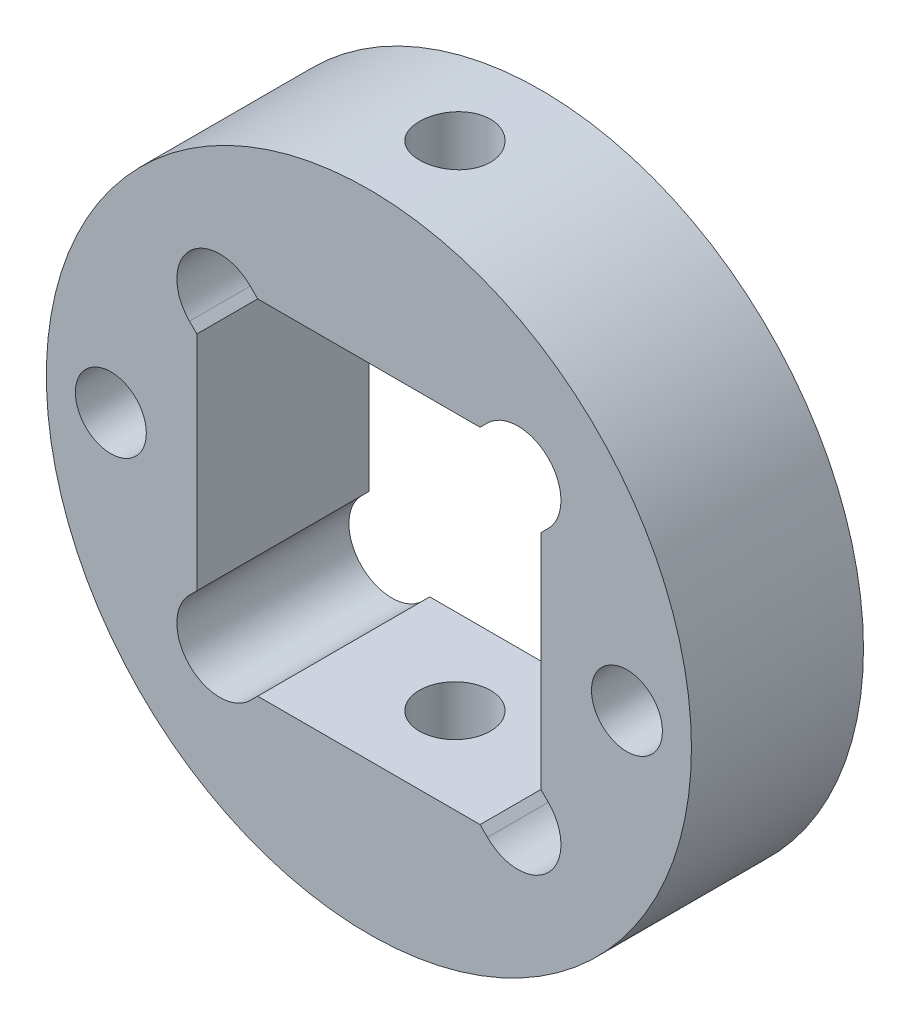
ISO-10303-21;
HEADER;
FILE_DESCRIPTION(('STEP AP214'),'2;1');
FILE_NAME('part.step','',(''),(''),'','','');
FILE_SCHEMA(('AUTOMOTIVE_DESIGN { 1 0 10303 214 1 1 1 1 }'));
ENDSEC;
DATA;
#1=APPLICATION_CONTEXT('core data for automotive mechanical design processes');
#2=APPLICATION_PROTOCOL_DEFINITION('international standard','automotive_design',2000,#1);
#3=PRODUCT_CONTEXT('',#1,'mechanical');
#4=PRODUCT('Part','Part','',(#3));
#5=PRODUCT_RELATED_PRODUCT_CATEGORY('part','',(#4));
#6=PRODUCT_DEFINITION_FORMATION('','',#4);
#7=PRODUCT_DEFINITION_CONTEXT('part definition',#1,'design');
#8=PRODUCT_DEFINITION('design','',#6,#7);
#9=PRODUCT_DEFINITION_SHAPE('','',#8);
#10=(LENGTH_UNIT() NAMED_UNIT(*) SI_UNIT(.MILLI.,.METRE.));
#11=(NAMED_UNIT(*) PLANE_ANGLE_UNIT() SI_UNIT($,.RADIAN.));
#12=(NAMED_UNIT(*) SI_UNIT($,.STERADIAN.) SOLID_ANGLE_UNIT());
#13=UNCERTAINTY_MEASURE_WITH_UNIT(LENGTH_MEASURE(1.E-05),#10,'distance_accuracy_value','');
#14=(GEOMETRIC_REPRESENTATION_CONTEXT(3) GLOBAL_UNCERTAINTY_ASSIGNED_CONTEXT((#13)) GLOBAL_UNIT_ASSIGNED_CONTEXT((#10,
#11,#12)) REPRESENTATION_CONTEXT('',''));
#15=CARTESIAN_POINT('',(0.,0.,0.));
#16=DIRECTION('',(0.,0.,1.));
#17=DIRECTION('',(1.,0.,0.));
#18=AXIS2_PLACEMENT_3D('',#15,#16,#17);
#19=CARTESIAN_POINT('',(0.,0.,4.));
#20=DIRECTION('',(0.,0.,1.));
#21=DIRECTION('',(1.,0.,0.));
#22=AXIS2_PLACEMENT_3D('',#19,#20,#21);
#23=PLANE('',#22);
#24=CARTESIAN_POINT('',(-12.,0.,4.));
#25=DIRECTION('',(0.,0.,1.));
#26=DIRECTION('',(1.,0.,0.));
#27=AXIS2_PLACEMENT_3D('',#24,#25,#26);
#28=CIRCLE('',#27,1.64999999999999);
#29=CARTESIAN_POINT('',(-10.35,0.,4.));
#30=VERTEX_POINT('',#29);
#31=EDGE_CURVE('E418',#30,#30,#28,.T.);
#32=ORIENTED_EDGE('',*,*,#31,.F.);
#33=EDGE_LOOP('',(#32));
#34=FACE_BOUND('',#33,.T.);
#35=CARTESIAN_POINT('',(12.,0.,4.));
#36=DIRECTION('',(0.,0.,1.));
#37=DIRECTION('',(1.,0.,0.));
#38=AXIS2_PLACEMENT_3D('',#35,#36,#37);
#39=CIRCLE('',#38,1.64999999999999);
#40=CARTESIAN_POINT('',(13.65,0.,4.));
#41=VERTEX_POINT('',#40);
#42=EDGE_CURVE('E413',#41,#41,#39,.T.);
#43=ORIENTED_EDGE('',*,*,#42,.F.);
#44=EDGE_LOOP('',(#43));
#45=FACE_BOUND('',#44,.T.);
#46=CARTESIAN_POINT('',(0.,0.,4.));
#47=DIRECTION('',(0.,0.,1.));
#48=DIRECTION('',(1.,0.,0.));
#49=AXIS2_PLACEMENT_3D('',#46,#47,#48);
#50=CIRCLE('',#49,15.);
#51=CARTESIAN_POINT('',(15.,0.,4.));
#52=VERTEX_POINT('',#51);
#53=EDGE_CURVE('E274',#52,#52,#50,.T.);
#54=ORIENTED_EDGE('',*,*,#53,.T.);
#55=EDGE_LOOP('',(#54));
#56=FACE_BOUND('',#55,.T.);
#57=CARTESIAN_POINT('',(6.92964645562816,6.92964645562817,4.));
#58=DIRECTION('',(0.,0.,1.));
#59=DIRECTION('',(1.,0.,0.));
#60=AXIS2_PLACEMENT_3D('',#57,#58,#59);
#61=CIRCLE('',#60,1.99999999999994);
#62=CARTESIAN_POINT('',(8.34386001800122,5.51543289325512,4.));
#63=VERTEX_POINT('',#62);
#64=CARTESIAN_POINT('',(5.51543289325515,8.34386001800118,4.));
#65=VERTEX_POINT('',#64);
#66=EDGE_CURVE('E159',#63,#65,#61,.T.);
#67=ORIENTED_EDGE('',*,*,#66,.F.);
#68=DIRECTION('',(0.707106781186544,0.707106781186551,0.));
#69=VECTOR('',#68,1.);
#70=CARTESIAN_POINT('',(8.34386001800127,5.51543289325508,4.));
#71=LINE('',#70,#69);
#72=CARTESIAN_POINT('',(8.,5.17157287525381,4.));
#73=VERTEX_POINT('',#72);
#74=EDGE_CURVE('E151',#73,#63,#71,.T.);
#75=ORIENTED_EDGE('',*,*,#74,.F.);
#76=DIRECTION('',(0.,1.,0.));
#77=VECTOR('',#76,1.);
#78=CARTESIAN_POINT('',(8.,5.17157287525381,4.));
#79=LINE('',#78,#77);
#80=CARTESIAN_POINT('',(8.00000000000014,-5.17157287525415,4.));
#81=VERTEX_POINT('',#80);
#82=EDGE_CURVE('E201',#81,#73,#79,.T.);
#83=ORIENTED_EDGE('',*,*,#82,.F.);
#84=DIRECTION('',(-0.707106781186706,0.707106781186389,0.));
#85=VECTOR('',#84,1.);
#86=CARTESIAN_POINT('',(8.34386001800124,-5.51543289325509,4.));
#87=LINE('',#86,#85);
#88=CARTESIAN_POINT('',(8.34386001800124,-5.51543289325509,4.));
#89=VERTEX_POINT('',#88);
#90=EDGE_CURVE('E199',#89,#81,#87,.T.);
#91=ORIENTED_EDGE('',*,*,#90,.F.);
#92=CARTESIAN_POINT('',(6.92964645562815,-6.92964645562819,4.));
#93=DIRECTION('',(0.,0.,1.));
#94=DIRECTION('',(1.,0.,0.));
#95=AXIS2_PLACEMENT_3D('',#92,#93,#94);
#96=CIRCLE('',#95,2.);
#97=CARTESIAN_POINT('',(5.51543289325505,-8.34386001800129,4.));
#98=VERTEX_POINT('',#97);
#99=EDGE_CURVE('E197',#98,#89,#96,.T.);
#100=ORIENTED_EDGE('',*,*,#99,.F.);
#101=DIRECTION('',(0.707106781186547,-0.707106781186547,0.));
#102=VECTOR('',#101,1.);
#103=CARTESIAN_POINT('',(5.51543289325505,-8.34386001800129,4.));
#104=LINE('',#103,#102);
#105=CARTESIAN_POINT('',(5.17157287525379,-8.00000000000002,4.));
#106=VERTEX_POINT('',#105);
#107=EDGE_CURVE('E195',#106,#98,#104,.T.);
#108=ORIENTED_EDGE('',*,*,#107,.F.);
#109=DIRECTION('',(1.,0.,0.));
#110=VECTOR('',#109,1.);
#111=CARTESIAN_POINT('',(-5.17157287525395,-8.00000000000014,4.));
#112=LINE('',#111,#110);
#113=CARTESIAN_POINT('',(-5.17157287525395,-8.00000000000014,4.));
#114=VERTEX_POINT('',#113);
#115=EDGE_CURVE('E193',#114,#106,#112,.T.);
#116=ORIENTED_EDGE('',*,*,#115,.F.);
#117=DIRECTION('',(0.707106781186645,0.70710678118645,0.));
#118=VECTOR('',#117,1.);
#119=CARTESIAN_POINT('',(-5.51543289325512,-8.34386001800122,4.));
#120=LINE('',#119,#118);
#121=CARTESIAN_POINT('',(-5.51543289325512,-8.34386001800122,4.));
#122=VERTEX_POINT('',#121);
#123=EDGE_CURVE('E191',#122,#114,#120,.T.);
#124=ORIENTED_EDGE('',*,*,#123,.F.);
#125=CARTESIAN_POINT('',(-6.92964645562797,-6.92964645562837,4.));
#126=DIRECTION('',(0.,0.,1.));
#127=DIRECTION('',(1.,0.,0.));
#128=AXIS2_PLACEMENT_3D('',#125,#126,#127);
#129=CIRCLE('',#128,1.99999999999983);
#130=CARTESIAN_POINT('',(-8.34386001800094,-5.5154328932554,4.));
#131=VERTEX_POINT('',#130);
#132=EDGE_CURVE('E189',#131,#122,#129,.T.);
#133=ORIENTED_EDGE('',*,*,#132,.F.);
#134=DIRECTION('',(-0.707106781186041,-0.707106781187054,0.));
#135=VECTOR('',#134,1.);
#136=CARTESIAN_POINT('',(-8.34386001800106,-5.51543289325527,4.));
#137=LINE('',#136,#135);
#138=CARTESIAN_POINT('',(-8.00000000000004,-5.17157287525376,4.));
#139=VERTEX_POINT('',#138);
#140=EDGE_CURVE('E187',#139,#131,#137,.T.);
#141=ORIENTED_EDGE('',*,*,#140,.F.);
#142=DIRECTION('',(0.,-1.,0.));
#143=VECTOR('',#142,1.);
#144=CARTESIAN_POINT('',(-7.99999999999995,5.17157287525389,4.));
#145=LINE('',#144,#143);
#146=CARTESIAN_POINT('',(-7.99999999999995,5.17157287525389,4.));
#147=VERTEX_POINT('',#146);
#148=EDGE_CURVE('E185',#147,#139,#145,.T.);
#149=ORIENTED_EDGE('',*,*,#148,.F.);
#150=DIRECTION('',(0.70710678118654,-0.707106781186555,0.));
#151=VECTOR('',#150,1.);
#152=CARTESIAN_POINT('',(-8.3438600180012,5.51543289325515,4.));
#153=LINE('',#152,#151);
#154=CARTESIAN_POINT('',(-8.3438600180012,5.51543289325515,4.));
#155=VERTEX_POINT('',#154);
#156=EDGE_CURVE('E183',#155,#147,#153,.T.);
#157=ORIENTED_EDGE('',*,*,#156,.F.);
#158=CARTESIAN_POINT('',(-6.9296464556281,6.92964645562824,4.));
#159=DIRECTION('',(0.,0.,1.));
#160=DIRECTION('',(1.,0.,0.));
#161=AXIS2_PLACEMENT_3D('',#158,#159,#160);
#162=CIRCLE('',#161,2.);
#163=CARTESIAN_POINT('',(-5.515432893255,8.34386001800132,4.));
#164=VERTEX_POINT('',#163);
#165=EDGE_CURVE('E181',#164,#155,#162,.T.);
#166=ORIENTED_EDGE('',*,*,#165,.F.);
#167=DIRECTION('',(-0.707106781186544,0.707106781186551,0.));
#168=VECTOR('',#167,1.);
#169=CARTESIAN_POINT('',(-5.515432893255,8.34386001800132,4.));
#170=LINE('',#169,#168);
#171=CARTESIAN_POINT('',(-5.17157287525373,8.00000000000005,4.));
#172=VERTEX_POINT('',#171);
#173=EDGE_CURVE('E179',#172,#164,#170,.T.);
#174=ORIENTED_EDGE('',*,*,#173,.F.);
#175=DIRECTION('',(-1.,0.,0.));
#176=VECTOR('',#175,1.);
#177=CARTESIAN_POINT('',(-5.17157287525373,8.00000000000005,4.));
#178=LINE('',#177,#176);
#179=CARTESIAN_POINT('',(5.17157287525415,7.99999999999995,4.));
#180=VERTEX_POINT('',#179);
#181=EDGE_CURVE('E174',#180,#172,#178,.T.);
#182=ORIENTED_EDGE('',*,*,#181,.F.);
#183=DIRECTION('',(-0.707106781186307,-0.707106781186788,0.));
#184=VECTOR('',#183,1.);
#185=CARTESIAN_POINT('',(5.51543289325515,8.34386001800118,4.));
#186=LINE('',#185,#184);
#187=EDGE_CURVE('E172',#65,#180,#186,.T.);
#188=ORIENTED_EDGE('',*,*,#187,.F.);
#189=EDGE_LOOP('',(#67,#75,#83,#91,#100,#108,#116,#124,#133,#141,#149,#157,#166,#174,#182,#188));
#190=FACE_BOUND('',#189,.T.);
#191=ADVANCED_FACE('F34',(#34,#45,#56,#190),#23,.T.);
#192=CARTESIAN_POINT('',(0.,0.,-4.));
#193=DIRECTION('',(0.,0.,1.));
#194=DIRECTION('',(1.,0.,0.));
#195=AXIS2_PLACEMENT_3D('',#192,#193,#194);
#196=PLANE('',#195);
#197=CARTESIAN_POINT('',(-12.,0.,-4.));
#198=DIRECTION('',(0.,0.,1.));
#199=DIRECTION('',(1.,0.,0.));
#200=AXIS2_PLACEMENT_3D('',#197,#198,#199);
#201=CIRCLE('',#200,1.65);
#202=CARTESIAN_POINT('',(-10.35,0.,-4.));
#203=VERTEX_POINT('',#202);
#204=EDGE_CURVE('E368',#203,#203,#201,.T.);
#205=ORIENTED_EDGE('',*,*,#204,.T.);
#206=EDGE_LOOP('',(#205));
#207=FACE_BOUND('',#206,.T.);
#208=CARTESIAN_POINT('',(12.,0.,-4.));
#209=DIRECTION('',(0.,0.,1.));
#210=DIRECTION('',(1.,0.,0.));
#211=AXIS2_PLACEMENT_3D('',#208,#209,#210);
#212=CIRCLE('',#211,1.65);
#213=CARTESIAN_POINT('',(13.65,0.,-4.));
#214=VERTEX_POINT('',#213);
#215=EDGE_CURVE('E204',#214,#214,#212,.T.);
#216=ORIENTED_EDGE('',*,*,#215,.T.);
#217=EDGE_LOOP('',(#216));
#218=FACE_BOUND('',#217,.T.);
#219=CARTESIAN_POINT('',(0.,0.,-4.));
#220=DIRECTION('',(0.,0.,1.));
#221=DIRECTION('',(1.,0.,0.));
#222=AXIS2_PLACEMENT_3D('',#219,#220,#221);
#223=CIRCLE('',#222,15.);
#224=CARTESIAN_POINT('',(15.,0.,-4.));
#225=VERTEX_POINT('',#224);
#226=EDGE_CURVE('E167',#225,#225,#223,.T.);
#227=ORIENTED_EDGE('',*,*,#226,.F.);
#228=EDGE_LOOP('',(#227));
#229=FACE_BOUND('',#228,.T.);
#230=DIRECTION('',(0.707106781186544,0.707106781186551,0.));
#231=VECTOR('',#230,1.);
#232=CARTESIAN_POINT('',(8.34386001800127,5.51543289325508,-4.));
#233=LINE('',#232,#231);
#234=CARTESIAN_POINT('',(8.,5.17157287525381,-4.));
#235=VERTEX_POINT('',#234);
#236=CARTESIAN_POINT('',(8.34386001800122,5.51543289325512,-4.));
#237=VERTEX_POINT('',#236);
#238=EDGE_CURVE('E61',#235,#237,#233,.T.);
#239=ORIENTED_EDGE('',*,*,#238,.T.);
#240=CARTESIAN_POINT('',(6.92964645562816,6.92964645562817,-4.));
#241=DIRECTION('',(0.,0.,1.));
#242=DIRECTION('',(1.,0.,0.));
#243=AXIS2_PLACEMENT_3D('',#240,#241,#242);
#244=CIRCLE('',#243,1.99999999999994);
#245=CARTESIAN_POINT('',(5.51543289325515,8.34386001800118,-4.));
#246=VERTEX_POINT('',#245);
#247=EDGE_CURVE('E166',#237,#246,#244,.T.);
#248=ORIENTED_EDGE('',*,*,#247,.T.);
#249=DIRECTION('',(-0.707106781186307,-0.707106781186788,0.));
#250=VECTOR('',#249,1.);
#251=CARTESIAN_POINT('',(5.51543289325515,8.34386001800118,-4.));
#252=LINE('',#251,#250);
#253=CARTESIAN_POINT('',(5.17157287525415,7.99999999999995,-4.));
#254=VERTEX_POINT('',#253);
#255=EDGE_CURVE('E206',#246,#254,#252,.T.);
#256=ORIENTED_EDGE('',*,*,#255,.T.);
#257=DIRECTION('',(-1.,0.,0.));
#258=VECTOR('',#257,1.);
#259=CARTESIAN_POINT('',(-5.17157287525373,8.00000000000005,-4.));
#260=LINE('',#259,#258);
#261=CARTESIAN_POINT('',(-5.17157287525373,8.00000000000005,-4.));
#262=VERTEX_POINT('',#261);
#263=EDGE_CURVE('E209',#254,#262,#260,.T.);
#264=ORIENTED_EDGE('',*,*,#263,.T.);
#265=DIRECTION('',(-0.707106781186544,0.707106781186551,0.));
#266=VECTOR('',#265,1.);
#267=CARTESIAN_POINT('',(-5.515432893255,8.34386001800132,-4.));
#268=LINE('',#267,#266);
#269=CARTESIAN_POINT('',(-5.515432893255,8.34386001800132,-4.));
#270=VERTEX_POINT('',#269);
#271=EDGE_CURVE('E212',#262,#270,#268,.T.);
#272=ORIENTED_EDGE('',*,*,#271,.T.);
#273=CARTESIAN_POINT('',(-6.9296464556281,6.92964645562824,-4.));
#274=DIRECTION('',(0.,0.,1.));
#275=DIRECTION('',(1.,0.,0.));
#276=AXIS2_PLACEMENT_3D('',#273,#274,#275);
#277=CIRCLE('',#276,2.);
#278=CARTESIAN_POINT('',(-8.3438600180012,5.51543289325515,-4.));
#279=VERTEX_POINT('',#278);
#280=EDGE_CURVE('E215',#270,#279,#277,.T.);
#281=ORIENTED_EDGE('',*,*,#280,.T.);
#282=DIRECTION('',(0.70710678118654,-0.707106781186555,0.));
#283=VECTOR('',#282,1.);
#284=CARTESIAN_POINT('',(-8.3438600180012,5.51543289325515,-4.));
#285=LINE('',#284,#283);
#286=CARTESIAN_POINT('',(-7.99999999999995,5.17157287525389,-4.));
#287=VERTEX_POINT('',#286);
#288=EDGE_CURVE('E218',#279,#287,#285,.T.);
#289=ORIENTED_EDGE('',*,*,#288,.T.);
#290=DIRECTION('',(0.,-1.,0.));
#291=VECTOR('',#290,1.);
#292=CARTESIAN_POINT('',(-7.99999999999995,5.17157287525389,-4.));
#293=LINE('',#292,#291);
#294=CARTESIAN_POINT('',(-8.00000000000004,-5.17157287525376,-4.));
#295=VERTEX_POINT('',#294);
#296=EDGE_CURVE('E221',#287,#295,#293,.T.);
#297=ORIENTED_EDGE('',*,*,#296,.T.);
#298=DIRECTION('',(-0.707106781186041,-0.707106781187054,0.));
#299=VECTOR('',#298,1.);
#300=CARTESIAN_POINT('',(-8.34386001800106,-5.51543289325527,-4.));
#301=LINE('',#300,#299);
#302=CARTESIAN_POINT('',(-8.34386001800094,-5.5154328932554,-4.));
#303=VERTEX_POINT('',#302);
#304=EDGE_CURVE('E224',#295,#303,#301,.T.);
#305=ORIENTED_EDGE('',*,*,#304,.T.);
#306=CARTESIAN_POINT('',(-6.92964645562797,-6.92964645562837,-4.));
#307=DIRECTION('',(0.,0.,1.));
#308=DIRECTION('',(1.,0.,0.));
#309=AXIS2_PLACEMENT_3D('',#306,#307,#308);
#310=CIRCLE('',#309,1.99999999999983);
#311=CARTESIAN_POINT('',(-5.51543289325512,-8.34386001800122,-4.));
#312=VERTEX_POINT('',#311);
#313=EDGE_CURVE('E227',#303,#312,#310,.T.);
#314=ORIENTED_EDGE('',*,*,#313,.T.);
#315=DIRECTION('',(0.707106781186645,0.70710678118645,0.));
#316=VECTOR('',#315,1.);
#317=CARTESIAN_POINT('',(-5.51543289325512,-8.34386001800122,-4.));
#318=LINE('',#317,#316);
#319=CARTESIAN_POINT('',(-5.17157287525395,-8.00000000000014,-4.));
#320=VERTEX_POINT('',#319);
#321=EDGE_CURVE('E230',#312,#320,#318,.T.);
#322=ORIENTED_EDGE('',*,*,#321,.T.);
#323=DIRECTION('',(1.,0.,0.));
#324=VECTOR('',#323,1.);
#325=CARTESIAN_POINT('',(-5.17157287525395,-8.00000000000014,-4.));
#326=LINE('',#325,#324);
#327=CARTESIAN_POINT('',(5.17157287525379,-8.00000000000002,-4.));
#328=VERTEX_POINT('',#327);
#329=EDGE_CURVE('E233',#320,#328,#326,.T.);
#330=ORIENTED_EDGE('',*,*,#329,.T.);
#331=DIRECTION('',(0.707106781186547,-0.707106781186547,0.));
#332=VECTOR('',#331,1.);
#333=CARTESIAN_POINT('',(5.51543289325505,-8.34386001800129,-4.));
#334=LINE('',#333,#332);
#335=CARTESIAN_POINT('',(5.51543289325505,-8.34386001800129,-4.));
#336=VERTEX_POINT('',#335);
#337=EDGE_CURVE('E236',#328,#336,#334,.T.);
#338=ORIENTED_EDGE('',*,*,#337,.T.);
#339=CARTESIAN_POINT('',(6.92964645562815,-6.92964645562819,-4.));
#340=DIRECTION('',(0.,0.,1.));
#341=DIRECTION('',(1.,0.,0.));
#342=AXIS2_PLACEMENT_3D('',#339,#340,#341);
#343=CIRCLE('',#342,2.);
#344=CARTESIAN_POINT('',(8.34386001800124,-5.51543289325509,-4.));
#345=VERTEX_POINT('',#344);
#346=EDGE_CURVE('E239',#336,#345,#343,.T.);
#347=ORIENTED_EDGE('',*,*,#346,.T.);
#348=DIRECTION('',(-0.707106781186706,0.707106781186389,0.));
#349=VECTOR('',#348,1.);
#350=CARTESIAN_POINT('',(8.34386001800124,-5.51543289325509,-4.));
#351=LINE('',#350,#349);
#352=CARTESIAN_POINT('',(8.00000000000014,-5.17157287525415,-4.));
#353=VERTEX_POINT('',#352);
#354=EDGE_CURVE('E242',#345,#353,#351,.T.);
#355=ORIENTED_EDGE('',*,*,#354,.T.);
#356=DIRECTION('',(0.,1.,0.));
#357=VECTOR('',#356,1.);
#358=CARTESIAN_POINT('',(8.,5.17157287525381,-4.));
#359=LINE('',#358,#357);
#360=EDGE_CURVE('E160',#353,#235,#359,.T.);
#361=ORIENTED_EDGE('',*,*,#360,.T.);
#362=EDGE_LOOP('',(#239,#248,#256,#264,#272,#281,#289,#297,#305,#314,#322,#330,#338,#347,#355,#361));
#363=FACE_BOUND('',#362,.T.);
#364=ADVANCED_FACE('F357',(#207,#218,#229,#363),#196,.F.);
#365=CARTESIAN_POINT('',(0.,0.,4.));
#366=DIRECTION('',(0.,0.,-1.));
#367=DIRECTION('',(-1.,0.,0.));
#368=AXIS2_PLACEMENT_3D('',#365,#366,#367);
#369=CYLINDRICAL_SURFACE('',#368,15.);
#370=CARTESIAN_POINT('',(0.,15.,-1.64999999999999));
#371=CARTESIAN_POINT('',(0.0923818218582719,14.9999988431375,-1.64999602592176));
#372=CARTESIAN_POINT('',(0.184823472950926,14.9991375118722,-1.64221531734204));
#373=CARTESIAN_POINT('',(0.367140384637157,14.9957843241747,-1.61129600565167));
#374=CARTESIAN_POINT('',(0.457012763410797,14.9932907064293,-1.58814081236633));
#375=CARTESIAN_POINT('',(0.631524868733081,14.9869542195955,-1.52715786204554));
#376=CARTESIAN_POINT('',(0.716167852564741,14.9831122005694,-1.48933934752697));
#377=CARTESIAN_POINT('',(0.877887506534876,14.9745076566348,-1.40012210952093));
#378=CARTESIAN_POINT('',(0.954965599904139,14.9697453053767,-1.34872594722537));
#379=CARTESIAN_POINT('',(1.09971749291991,14.9598099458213,-1.23357486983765));
#380=CARTESIAN_POINT('',(1.16735402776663,14.9546354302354,-1.16977323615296));
#381=CARTESIAN_POINT('',(1.29098229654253,14.9444712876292,-1.03172228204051));
#382=CARTESIAN_POINT('',(1.34697347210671,14.9394816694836,-0.957472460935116));
#383=CARTESIAN_POINT('',(1.44585644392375,14.9302371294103,-0.800395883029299));
#384=CARTESIAN_POINT('',(1.48871403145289,14.9259841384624,-0.717547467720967));
#385=CARTESIAN_POINT('',(1.55989482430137,14.9187136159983,-0.545775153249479));
#386=CARTESIAN_POINT('',(1.5882184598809,14.9156960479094,-0.456851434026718));
#387=CARTESIAN_POINT('',(1.6294157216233,14.9112520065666,-0.275835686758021));
#388=CARTESIAN_POINT('',(1.6423516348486,14.9098191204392,-0.183757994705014));
#389=CARTESIAN_POINT('',(1.65259886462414,14.908686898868,0.00127181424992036));
#390=CARTESIAN_POINT('',(1.64991067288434,14.908987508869,0.0942239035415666));
#391=CARTESIAN_POINT('',(1.62903725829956,14.9112824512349,0.277932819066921));
#392=CARTESIAN_POINT('',(1.61092026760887,14.9132693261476,0.368697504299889));
#393=CARTESIAN_POINT('',(1.55980980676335,14.9187012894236,0.545890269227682));
#394=CARTESIAN_POINT('',(1.52681609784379,14.9221464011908,0.632318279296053));
#395=CARTESIAN_POINT('',(1.44681419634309,14.9301152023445,0.798598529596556));
#396=CARTESIAN_POINT('',(1.39977596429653,14.9346411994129,0.878436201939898));
#397=CARTESIAN_POINT('',(1.29304180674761,14.944259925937,1.02910998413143));
#398=CARTESIAN_POINT('',(1.23334543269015,14.9493526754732,1.0999457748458));
#399=CARTESIAN_POINT('',(1.10260955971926,14.9595642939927,1.23100135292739));
#400=CARTESIAN_POINT('',(1.03151117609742,14.9646831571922,1.291162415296));
#401=CARTESIAN_POINT('',(0.880193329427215,14.9743446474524,1.39870484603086));
#402=CARTESIAN_POINT('',(0.799973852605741,14.978887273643,1.446086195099));
#403=CARTESIAN_POINT('',(0.632648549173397,14.9868864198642,1.52672275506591));
#404=CARTESIAN_POINT('',(0.545541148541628,14.9903426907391,1.55997472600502));
#405=CARTESIAN_POINT('',(0.366932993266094,14.9957772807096,1.61136425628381));
#406=CARTESIAN_POINT('',(0.275432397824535,14.9977556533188,1.62950236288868));
#407=CARTESIAN_POINT('',(0.0911434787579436,15.0000046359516,1.65007418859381));
#408=CARTESIAN_POINT('',(-0.00163570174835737,15.0002840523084,1.65258889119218));
#409=CARTESIAN_POINT('',(-0.186294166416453,14.9991273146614,1.64205560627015));
#410=CARTESIAN_POINT('',(-0.278173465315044,14.9976911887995,1.62900787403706));
#411=CARTESIAN_POINT('',(-0.45818836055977,14.9932703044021,1.58778731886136));
#412=CARTESIAN_POINT('',(-0.546332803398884,14.9902894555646,1.5596526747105));
#413=CARTESIAN_POINT('',(-0.716651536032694,14.9831132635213,1.48909634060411));
#414=CARTESIAN_POINT('',(-0.798825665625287,14.9789178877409,1.44667426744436));
#415=CARTESIAN_POINT('',(-0.955235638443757,14.9697593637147,1.34854827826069));
#416=CARTESIAN_POINT('',(-1.02943811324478,14.9647931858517,1.2927914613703));
#417=CARTESIAN_POINT('',(-1.1674600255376,14.9546593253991,1.16965418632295));
#418=CARTESIAN_POINT('',(-1.23127914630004,14.9494916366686,1.10227337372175));
#419=CARTESIAN_POINT('',(-1.34700625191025,14.9395104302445,0.957446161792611));
#420=CARTESIAN_POINT('',(-1.39886088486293,14.9346985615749,0.879957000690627));
#421=CARTESIAN_POINT('',(-1.48881961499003,14.9259997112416,0.717322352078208));
#422=CARTESIAN_POINT('',(-1.52692393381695,14.9221127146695,0.632176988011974));
#423=CARTESIAN_POINT('',(-1.58821216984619,14.9157144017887,0.456825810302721));
#424=CARTESIAN_POINT('',(-1.61142720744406,14.913200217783,0.366630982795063));
#425=CARTESIAN_POINT('',(-1.64237859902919,14.9098235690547,0.183594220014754));
#426=CARTESIAN_POINT('',(-1.65011549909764,14.9089610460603,0.0907523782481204));
#427=CARTESIAN_POINT('',(-1.64988250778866,14.9089867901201,-0.0944125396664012));
#428=CARTESIAN_POINT('',(-1.64199642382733,14.9098657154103,-0.186735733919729));
#429=CARTESIAN_POINT('',(-1.61091769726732,14.9132553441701,-0.368736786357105));
#430=CARTESIAN_POINT('',(-1.58772504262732,14.9157660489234,-0.45841464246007));
#431=CARTESIAN_POINT('',(-1.52671583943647,14.9221336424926,-0.632574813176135));
#432=CARTESIAN_POINT('',(-1.48890235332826,14.9259902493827,-0.717058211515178));
#433=CARTESIAN_POINT('',(-1.39973329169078,14.9346156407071,-0.878493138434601));
#434=CARTESIAN_POINT('',(-1.34837769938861,14.9393844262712,-0.955444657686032));
#435=CARTESIAN_POINT('',(-1.23326864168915,14.9493275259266,-1.1000607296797));
#436=CARTESIAN_POINT('',(-1.16945266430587,14.9545038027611,-1.16767539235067));
#437=CARTESIAN_POINT('',(-1.03136150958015,14.9646609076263,-1.29127092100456));
#438=CARTESIAN_POINT('',(-0.957083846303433,14.969641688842,-1.34724901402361));
#439=CARTESIAN_POINT('',(-0.799929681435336,14.9788625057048,-1.44611876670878));
#440=CARTESIAN_POINT('',(-0.717028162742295,14.9831002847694,-1.48897084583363));
#441=CARTESIAN_POINT('',(-0.54520988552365,14.9903338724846,-1.56008722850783));
#442=CARTESIAN_POINT('',(-0.456299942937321,14.993331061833,-1.58836775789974));
#443=CARTESIAN_POINT('',(-0.305751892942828,14.9970040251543,-1.62259125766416));
#444=CARTESIAN_POINT('',(-0.245071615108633,14.9981221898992,-1.6328552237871));
#445=CARTESIAN_POINT('',(-0.122936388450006,14.9996205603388,-1.64656089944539));
#446=CARTESIAN_POINT('',(-0.0614814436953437,15.0000007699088,-1.65000264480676));
#447=CARTESIAN_POINT('',(0.,15.,-1.64999999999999));
#448=B_SPLINE_CURVE_WITH_KNOTS('',3,(#370,#371,#372,#373,#374,#375,#376,#377,#378,#379,#380,
#381,#382,#383,#384,#385,#386,#387,#388,#389,#390,#391,#392,#393,#394,#395,#396,#397,#398,#399,
#400,#401,#402,#403,#404,#405,#406,#407,#408,#409,#410,#411,#412,#413,#414,#415,#416,#417,#418,
#419,#420,#421,#422,#423,#424,#425,#426,#427,#428,#429,#430,#431,#432,#433,#434,#435,#436,#437,
#438,#439,#440,#441,#442,#443,#444,#445,#446,#447),.UNSPECIFIED.,.T.,.F.,(4,2,2,2,2,2,2,2,2,2,2,
2,2,2,2,2,2,2,2,2,2,2,2,2,2,2,2,2,2,2,2,2,2,2,2,2,2,2,4),(0.,0.276920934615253,
0.554141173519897,0.831186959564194,1.10818052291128,1.38623817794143,1.66430916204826,
1.94309839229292,2.22187936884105,2.49952800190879,2.77716789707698,3.05358629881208,
3.33000913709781,3.6070274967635,3.88405567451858,4.16256356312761,4.44107187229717,
4.71964401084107,4.99820606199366,5.27532298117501,5.55243535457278,5.82884975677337,
6.10527157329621,6.38280873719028,6.6603543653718,6.93911468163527,7.21787050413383,
7.49604177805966,7.77420323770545,8.05087657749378,8.3275501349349,8.60416577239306,
8.88078175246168,9.15882288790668,9.4369302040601,9.71586805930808,9.99449463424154,
10.1787905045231,10.3630854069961),.UNSPECIFIED.);
#449=CARTESIAN_POINT('',(0.,15.,-1.64999999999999));
#450=VERTEX_POINT('',#449);
#451=EDGE_CURVE('E11',#450,#450,#448,.T.);
#452=ORIENTED_EDGE('',*,*,#451,.T.);
#453=EDGE_LOOP('',(#452));
#454=FACE_BOUND('',#453,.T.);
#455=CARTESIAN_POINT('',(0.,-15.,1.64999999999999));
#456=CARTESIAN_POINT('',(0.0923818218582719,-14.9999988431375,1.64999602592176));
#457=CARTESIAN_POINT('',(0.184823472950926,-14.9991375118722,1.64221531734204));
#458=CARTESIAN_POINT('',(0.367140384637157,-14.9957843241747,1.61129600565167));
#459=CARTESIAN_POINT('',(0.457012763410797,-14.9932907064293,1.58814081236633));
#460=CARTESIAN_POINT('',(0.631524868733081,-14.9869542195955,1.52715786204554));
#461=CARTESIAN_POINT('',(0.716167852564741,-14.9831122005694,1.48933934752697));
#462=CARTESIAN_POINT('',(0.877887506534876,-14.9745076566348,1.40012210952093));
#463=CARTESIAN_POINT('',(0.954965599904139,-14.9697453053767,1.34872594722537));
#464=CARTESIAN_POINT('',(1.09971749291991,-14.9598099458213,1.23357486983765));
#465=CARTESIAN_POINT('',(1.16735402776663,-14.9546354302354,1.16977323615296));
#466=CARTESIAN_POINT('',(1.29098229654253,-14.9444712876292,1.03172228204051));
#467=CARTESIAN_POINT('',(1.34697347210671,-14.9394816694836,0.957472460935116));
#468=CARTESIAN_POINT('',(1.44585644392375,-14.9302371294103,0.800395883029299));
#469=CARTESIAN_POINT('',(1.48871403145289,-14.9259841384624,0.717547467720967));
#470=CARTESIAN_POINT('',(1.55989482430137,-14.9187136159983,0.545775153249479));
#471=CARTESIAN_POINT('',(1.5882184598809,-14.9156960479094,0.456851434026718));
#472=CARTESIAN_POINT('',(1.6294157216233,-14.9112520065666,0.275835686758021));
#473=CARTESIAN_POINT('',(1.6423516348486,-14.9098191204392,0.183757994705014));
#474=CARTESIAN_POINT('',(1.65259886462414,-14.908686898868,-0.00127181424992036));
#475=CARTESIAN_POINT('',(1.64991067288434,-14.908987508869,-0.0942239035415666));
#476=CARTESIAN_POINT('',(1.62903725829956,-14.9112824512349,-0.277932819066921));
#477=CARTESIAN_POINT('',(1.61092026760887,-14.9132693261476,-0.368697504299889));
#478=CARTESIAN_POINT('',(1.55980980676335,-14.9187012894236,-0.545890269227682));
#479=CARTESIAN_POINT('',(1.52681609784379,-14.9221464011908,-0.632318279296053));
#480=CARTESIAN_POINT('',(1.44681419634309,-14.9301152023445,-0.798598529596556));
#481=CARTESIAN_POINT('',(1.39977596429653,-14.9346411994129,-0.878436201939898));
#482=CARTESIAN_POINT('',(1.29304180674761,-14.944259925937,-1.02910998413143));
#483=CARTESIAN_POINT('',(1.23334543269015,-14.9493526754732,-1.0999457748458));
#484=CARTESIAN_POINT('',(1.10260955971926,-14.9595642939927,-1.23100135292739));
#485=CARTESIAN_POINT('',(1.03151117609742,-14.9646831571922,-1.291162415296));
#486=CARTESIAN_POINT('',(0.880193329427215,-14.9743446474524,-1.39870484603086));
#487=CARTESIAN_POINT('',(0.799973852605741,-14.978887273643,-1.446086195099));
#488=CARTESIAN_POINT('',(0.632648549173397,-14.9868864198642,-1.52672275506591));
#489=CARTESIAN_POINT('',(0.545541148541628,-14.9903426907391,-1.55997472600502));
#490=CARTESIAN_POINT('',(0.366932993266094,-14.9957772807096,-1.61136425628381));
#491=CARTESIAN_POINT('',(0.275432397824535,-14.9977556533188,-1.62950236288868));
#492=CARTESIAN_POINT('',(0.0911434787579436,-15.0000046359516,-1.65007418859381));
#493=CARTESIAN_POINT('',(-0.00163570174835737,-15.0002840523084,-1.65258889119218));
#494=CARTESIAN_POINT('',(-0.186294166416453,-14.9991273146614,-1.64205560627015));
#495=CARTESIAN_POINT('',(-0.278173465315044,-14.9976911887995,-1.62900787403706));
#496=CARTESIAN_POINT('',(-0.45818836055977,-14.9932703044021,-1.58778731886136));
#497=CARTESIAN_POINT('',(-0.546332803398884,-14.9902894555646,-1.5596526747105));
#498=CARTESIAN_POINT('',(-0.716651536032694,-14.9831132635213,-1.48909634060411));
#499=CARTESIAN_POINT('',(-0.798825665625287,-14.9789178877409,-1.44667426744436));
#500=CARTESIAN_POINT('',(-0.955235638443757,-14.9697593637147,-1.34854827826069));
#501=CARTESIAN_POINT('',(-1.02943811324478,-14.9647931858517,-1.2927914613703));
#502=CARTESIAN_POINT('',(-1.1674600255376,-14.9546593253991,-1.16965418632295));
#503=CARTESIAN_POINT('',(-1.23127914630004,-14.9494916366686,-1.10227337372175));
#504=CARTESIAN_POINT('',(-1.34700625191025,-14.9395104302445,-0.957446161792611));
#505=CARTESIAN_POINT('',(-1.39886088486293,-14.9346985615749,-0.879957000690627));
#506=CARTESIAN_POINT('',(-1.48881961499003,-14.9259997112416,-0.717322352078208));
#507=CARTESIAN_POINT('',(-1.52692393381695,-14.9221127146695,-0.632176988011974));
#508=CARTESIAN_POINT('',(-1.58821216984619,-14.9157144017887,-0.456825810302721));
#509=CARTESIAN_POINT('',(-1.61142720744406,-14.913200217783,-0.366630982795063));
#510=CARTESIAN_POINT('',(-1.64237859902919,-14.9098235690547,-0.183594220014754));
#511=CARTESIAN_POINT('',(-1.65011549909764,-14.9089610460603,-0.0907523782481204));
#512=CARTESIAN_POINT('',(-1.64988250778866,-14.9089867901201,0.0944125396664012));
#513=CARTESIAN_POINT('',(-1.64199642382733,-14.9098657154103,0.186735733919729));
#514=CARTESIAN_POINT('',(-1.61091769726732,-14.9132553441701,0.368736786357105));
#515=CARTESIAN_POINT('',(-1.58772504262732,-14.9157660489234,0.45841464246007));
#516=CARTESIAN_POINT('',(-1.52671583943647,-14.9221336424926,0.632574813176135));
#517=CARTESIAN_POINT('',(-1.48890235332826,-14.9259902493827,0.717058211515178));
#518=CARTESIAN_POINT('',(-1.39973329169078,-14.9346156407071,0.878493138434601));
#519=CARTESIAN_POINT('',(-1.34837769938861,-14.9393844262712,0.955444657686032));
#520=CARTESIAN_POINT('',(-1.23326864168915,-14.9493275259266,1.1000607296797));
#521=CARTESIAN_POINT('',(-1.16945266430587,-14.9545038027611,1.16767539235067));
#522=CARTESIAN_POINT('',(-1.03136150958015,-14.9646609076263,1.29127092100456));
#523=CARTESIAN_POINT('',(-0.957083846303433,-14.969641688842,1.34724901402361));
#524=CARTESIAN_POINT('',(-0.799929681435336,-14.9788625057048,1.44611876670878));
#525=CARTESIAN_POINT('',(-0.717028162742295,-14.9831002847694,1.48897084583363));
#526=CARTESIAN_POINT('',(-0.54520988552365,-14.9903338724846,1.56008722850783));
#527=CARTESIAN_POINT('',(-0.456299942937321,-14.993331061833,1.58836775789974));
#528=CARTESIAN_POINT('',(-0.305751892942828,-14.9970040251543,1.62259125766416));
#529=CARTESIAN_POINT('',(-0.245071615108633,-14.9981221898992,1.6328552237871));
#530=CARTESIAN_POINT('',(-0.122936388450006,-14.9996205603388,1.64656089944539));
#531=CARTESIAN_POINT('',(-0.0614814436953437,-15.0000007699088,1.65000264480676));
#532=CARTESIAN_POINT('',(0.,-15.,1.64999999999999));
#533=B_SPLINE_CURVE_WITH_KNOTS('',3,(#455,#456,#457,#458,#459,#460,#461,#462,#463,#464,#465,
#466,#467,#468,#469,#470,#471,#472,#473,#474,#475,#476,#477,#478,#479,#480,#481,#482,#483,#484,
#485,#486,#487,#488,#489,#490,#491,#492,#493,#494,#495,#496,#497,#498,#499,#500,#501,#502,#503,
#504,#505,#506,#507,#508,#509,#510,#511,#512,#513,#514,#515,#516,#517,#518,#519,#520,#521,#522,
#523,#524,#525,#526,#527,#528,#529,#530,#531,#532),.UNSPECIFIED.,.T.,.F.,(4,2,2,2,2,2,2,2,2,2,2,
2,2,2,2,2,2,2,2,2,2,2,2,2,2,2,2,2,2,2,2,2,2,2,2,2,2,2,4),(0.,0.276920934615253,
0.554141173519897,0.831186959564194,1.10818052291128,1.38623817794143,1.66430916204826,
1.94309839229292,2.22187936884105,2.49952800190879,2.77716789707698,3.05358629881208,
3.33000913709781,3.6070274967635,3.88405567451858,4.16256356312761,4.44107187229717,
4.71964401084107,4.99820606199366,5.27532298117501,5.55243535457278,5.82884975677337,
6.10527157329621,6.38280873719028,6.6603543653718,6.93911468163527,7.21787050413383,
7.49604177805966,7.77420323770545,8.05087657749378,8.3275501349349,8.60416577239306,
8.88078175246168,9.15882288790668,9.4369302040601,9.71586805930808,9.99449463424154,
10.1787905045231,10.3630854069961),.UNSPECIFIED.);
#534=CARTESIAN_POINT('',(0.,-15.,1.64999999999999));
#535=VERTEX_POINT('',#534);
#536=EDGE_CURVE('E46',#535,#535,#533,.T.);
#537=ORIENTED_EDGE('',*,*,#536,.T.);
#538=EDGE_LOOP('',(#537));
#539=FACE_BOUND('',#538,.T.);
#540=ORIENTED_EDGE('',*,*,#53,.F.);
#541=EDGE_LOOP('',(#540));
#542=FACE_BOUND('',#541,.T.);
#543=ORIENTED_EDGE('',*,*,#226,.T.);
#544=EDGE_LOOP('',(#543));
#545=FACE_BOUND('',#544,.T.);
#546=ADVANCED_FACE('F36',(#454,#539,#542,#545),#369,.T.);
#547=CARTESIAN_POINT('',(8.34386001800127,5.51543289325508,4.));
#548=DIRECTION('',(-0.707106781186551,0.707106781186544,0.));
#549=DIRECTION('',(-0.707106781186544,-0.707106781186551,0.));
#550=AXIS2_PLACEMENT_3D('',#547,#548,#549);
#551=PLANE('',#550);
#552=ORIENTED_EDGE('',*,*,#238,.F.);
#553=DIRECTION('',(0.,0.,-1.));
#554=VECTOR('',#553,1.);
#555=CARTESIAN_POINT('',(8.,5.17157287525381,4.));
#556=LINE('',#555,#554);
#557=EDGE_CURVE('E155',#73,#235,#556,.T.);
#558=ORIENTED_EDGE('',*,*,#557,.F.);
#559=ORIENTED_EDGE('',*,*,#74,.T.);
#560=DIRECTION('',(0.,0.,-1.));
#561=VECTOR('',#560,1.);
#562=CARTESIAN_POINT('',(8.34386001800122,5.51543289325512,4.));
#563=LINE('',#562,#561);
#564=EDGE_CURVE('E154',#63,#237,#563,.T.);
#565=ORIENTED_EDGE('',*,*,#564,.T.);
#566=EDGE_LOOP('',(#552,#558,#559,#565));
#567=FACE_BOUND('',#566,.T.);
#568=ADVANCED_FACE('F153',(#567),#551,.T.);
#569=CARTESIAN_POINT('',(6.92964645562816,6.92964645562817,4.));
#570=DIRECTION('',(0.,0.,-1.));
#571=DIRECTION('',(-1.,0.,0.));
#572=AXIS2_PLACEMENT_3D('',#569,#570,#571);
#573=CYLINDRICAL_SURFACE('',#572,1.99999999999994);
#574=ORIENTED_EDGE('',*,*,#247,.F.);
#575=ORIENTED_EDGE('',*,*,#564,.F.);
#576=ORIENTED_EDGE('',*,*,#66,.T.);
#577=DIRECTION('',(0.,0.,-1.));
#578=VECTOR('',#577,1.);
#579=CARTESIAN_POINT('',(5.51543289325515,8.34386001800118,4.));
#580=LINE('',#579,#578);
#581=EDGE_CURVE('E168',#65,#246,#580,.T.);
#582=ORIENTED_EDGE('',*,*,#581,.T.);
#583=EDGE_LOOP('',(#574,#575,#576,#582));
#584=FACE_BOUND('',#583,.T.);
#585=ADVANCED_FACE('F163',(#584),#573,.F.);
#586=CARTESIAN_POINT('',(5.51543289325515,8.34386001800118,4.));
#587=DIRECTION('',(0.707106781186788,-0.707106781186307,0.));
#588=DIRECTION('',(0.707106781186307,0.707106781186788,0.));
#589=AXIS2_PLACEMENT_3D('',#586,#587,#588);
#590=PLANE('',#589);
#591=ORIENTED_EDGE('',*,*,#255,.F.);
#592=ORIENTED_EDGE('',*,*,#581,.F.);
#593=ORIENTED_EDGE('',*,*,#187,.T.);
#594=DIRECTION('',(0.,0.,-1.));
#595=VECTOR('',#594,1.);
#596=CARTESIAN_POINT('',(5.17157287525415,7.99999999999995,4.));
#597=LINE('',#596,#595);
#598=EDGE_CURVE('E271',#180,#254,#597,.T.);
#599=ORIENTED_EDGE('',*,*,#598,.T.);
#600=EDGE_LOOP('',(#591,#592,#593,#599));
#601=FACE_BOUND('',#600,.T.);
#602=ADVANCED_FACE('F347',(#601),#590,.T.);
#603=CARTESIAN_POINT('',(-5.17157287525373,8.00000000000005,4.));
#604=DIRECTION('',(0.,-1.,0.));
#605=DIRECTION('',(1.,0.,0.));
#606=AXIS2_PLACEMENT_3D('',#603,#604,#605);
#607=PLANE('',#606);
#608=CARTESIAN_POINT('',(0.,8.00000000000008,0.));
#609=DIRECTION('',(0.,-1.,0.));
#610=DIRECTION('',(0.,0.,-1.));
#611=AXIS2_PLACEMENT_3D('',#608,#609,#610);
#612=CIRCLE('',#611,1.64999999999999);
#613=CARTESIAN_POINT('',(0.,8.00000000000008,-1.64999999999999));
#614=VERTEX_POINT('',#613);
#615=EDGE_CURVE('E424',#614,#614,#612,.T.);
#616=ORIENTED_EDGE('',*,*,#615,.F.);
#617=EDGE_LOOP('',(#616));
#618=FACE_BOUND('',#617,.T.);
#619=ORIENTED_EDGE('',*,*,#263,.F.);
#620=ORIENTED_EDGE('',*,*,#598,.F.);
#621=ORIENTED_EDGE('',*,*,#181,.T.);
#622=DIRECTION('',(0.,0.,-1.));
#623=VECTOR('',#622,1.);
#624=CARTESIAN_POINT('',(-5.17157287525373,8.00000000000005,4.));
#625=LINE('',#624,#623);
#626=EDGE_CURVE('E269',#172,#262,#625,.T.);
#627=ORIENTED_EDGE('',*,*,#626,.T.);
#628=EDGE_LOOP('',(#619,#620,#621,#627));
#629=FACE_BOUND('',#628,.T.);
#630=ADVANCED_FACE('F343',(#618,#629),#607,.T.);
#631=CARTESIAN_POINT('',(-5.515432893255,8.34386001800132,4.));
#632=DIRECTION('',(-0.707106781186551,-0.707106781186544,0.));
#633=DIRECTION('',(0.707106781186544,-0.707106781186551,0.));
#634=AXIS2_PLACEMENT_3D('',#631,#632,#633);
#635=PLANE('',#634);
#636=ORIENTED_EDGE('',*,*,#271,.F.);
#637=ORIENTED_EDGE('',*,*,#626,.F.);
#638=ORIENTED_EDGE('',*,*,#173,.T.);
#639=DIRECTION('',(0.,0.,-1.));
#640=VECTOR('',#639,1.);
#641=CARTESIAN_POINT('',(-5.515432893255,8.34386001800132,4.));
#642=LINE('',#641,#640);
#643=EDGE_CURVE('E267',#164,#270,#642,.T.);
#644=ORIENTED_EDGE('',*,*,#643,.T.);
#645=EDGE_LOOP('',(#636,#637,#638,#644));
#646=FACE_BOUND('',#645,.T.);
#647=ADVANCED_FACE('F339',(#646),#635,.T.);
#648=CARTESIAN_POINT('',(-6.9296464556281,6.92964645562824,4.));
#649=DIRECTION('',(0.,0.,-1.));
#650=DIRECTION('',(-1.,0.,0.));
#651=AXIS2_PLACEMENT_3D('',#648,#649,#650);
#652=CYLINDRICAL_SURFACE('',#651,2.);
#653=ORIENTED_EDGE('',*,*,#280,.F.);
#654=ORIENTED_EDGE('',*,*,#643,.F.);
#655=ORIENTED_EDGE('',*,*,#165,.T.);
#656=DIRECTION('',(0.,0.,-1.));
#657=VECTOR('',#656,1.);
#658=CARTESIAN_POINT('',(-8.3438600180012,5.51543289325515,4.));
#659=LINE('',#658,#657);
#660=EDGE_CURVE('E265',#155,#279,#659,.T.);
#661=ORIENTED_EDGE('',*,*,#660,.T.);
#662=EDGE_LOOP('',(#653,#654,#655,#661));
#663=FACE_BOUND('',#662,.T.);
#664=ADVANCED_FACE('F335',(#663),#652,.F.);
#665=CARTESIAN_POINT('',(-8.3438600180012,5.51543289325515,4.));
#666=DIRECTION('',(0.707106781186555,0.70710678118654,0.));
#667=DIRECTION('',(-0.70710678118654,0.707106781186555,0.));
#668=AXIS2_PLACEMENT_3D('',#665,#666,#667);
#669=PLANE('',#668);
#670=ORIENTED_EDGE('',*,*,#288,.F.);
#671=ORIENTED_EDGE('',*,*,#660,.F.);
#672=ORIENTED_EDGE('',*,*,#156,.T.);
#673=DIRECTION('',(0.,0.,-1.));
#674=VECTOR('',#673,1.);
#675=CARTESIAN_POINT('',(-7.99999999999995,5.17157287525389,4.));
#676=LINE('',#675,#674);
#677=EDGE_CURVE('E263',#147,#287,#676,.T.);
#678=ORIENTED_EDGE('',*,*,#677,.T.);
#679=EDGE_LOOP('',(#670,#671,#672,#678));
#680=FACE_BOUND('',#679,.T.);
#681=ADVANCED_FACE('F331',(#680),#669,.T.);
#682=CARTESIAN_POINT('',(-7.99999999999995,5.17157287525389,4.));
#683=DIRECTION('',(1.,0.,0.));
#684=DIRECTION('',(0.,1.,0.));
#685=AXIS2_PLACEMENT_3D('',#682,#683,#684);
#686=PLANE('',#685);
#687=ORIENTED_EDGE('',*,*,#296,.F.);
#688=ORIENTED_EDGE('',*,*,#677,.F.);
#689=ORIENTED_EDGE('',*,*,#148,.T.);
#690=DIRECTION('',(0.,0.,-1.));
#691=VECTOR('',#690,1.);
#692=CARTESIAN_POINT('',(-8.00000000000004,-5.17157287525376,4.));
#693=LINE('',#692,#691);
#694=EDGE_CURVE('E261',#139,#295,#693,.T.);
#695=ORIENTED_EDGE('',*,*,#694,.T.);
#696=EDGE_LOOP('',(#687,#688,#689,#695));
#697=FACE_BOUND('',#696,.T.);
#698=ADVANCED_FACE('F327',(#697),#686,.T.);
#699=CARTESIAN_POINT('',(-8.34386001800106,-5.51543289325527,4.));
#700=DIRECTION('',(0.707106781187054,-0.707106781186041,0.));
#701=DIRECTION('',(0.707106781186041,0.707106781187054,0.));
#702=AXIS2_PLACEMENT_3D('',#699,#700,#701);
#703=PLANE('',#702);
#704=ORIENTED_EDGE('',*,*,#304,.F.);
#705=ORIENTED_EDGE('',*,*,#694,.F.);
#706=ORIENTED_EDGE('',*,*,#140,.T.);
#707=DIRECTION('',(0.,0.,-1.));
#708=VECTOR('',#707,1.);
#709=CARTESIAN_POINT('',(-8.34386001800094,-5.5154328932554,4.));
#710=LINE('',#709,#708);
#711=EDGE_CURVE('E259',#131,#303,#710,.T.);
#712=ORIENTED_EDGE('',*,*,#711,.T.);
#713=EDGE_LOOP('',(#704,#705,#706,#712));
#714=FACE_BOUND('',#713,.T.);
#715=ADVANCED_FACE('F323',(#714),#703,.T.);
#716=CARTESIAN_POINT('',(-6.92964645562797,-6.92964645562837,4.));
#717=DIRECTION('',(0.,0.,-1.));
#718=DIRECTION('',(-1.,0.,0.));
#719=AXIS2_PLACEMENT_3D('',#716,#717,#718);
#720=CYLINDRICAL_SURFACE('',#719,1.99999999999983);
#721=ORIENTED_EDGE('',*,*,#313,.F.);
#722=ORIENTED_EDGE('',*,*,#711,.F.);
#723=ORIENTED_EDGE('',*,*,#132,.T.);
#724=DIRECTION('',(0.,0.,-1.));
#725=VECTOR('',#724,1.);
#726=CARTESIAN_POINT('',(-5.51543289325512,-8.34386001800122,4.));
#727=LINE('',#726,#725);
#728=EDGE_CURVE('E257',#122,#312,#727,.T.);
#729=ORIENTED_EDGE('',*,*,#728,.T.);
#730=EDGE_LOOP('',(#721,#722,#723,#729));
#731=FACE_BOUND('',#730,.T.);
#732=ADVANCED_FACE('F319',(#731),#720,.F.);
#733=CARTESIAN_POINT('',(-5.51543289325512,-8.34386001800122,4.));
#734=DIRECTION('',(-0.70710678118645,0.707106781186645,0.));
#735=DIRECTION('',(-0.707106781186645,-0.70710678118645,0.));
#736=AXIS2_PLACEMENT_3D('',#733,#734,#735);
#737=PLANE('',#736);
#738=ORIENTED_EDGE('',*,*,#321,.F.);
#739=ORIENTED_EDGE('',*,*,#728,.F.);
#740=ORIENTED_EDGE('',*,*,#123,.T.);
#741=DIRECTION('',(0.,0.,-1.));
#742=VECTOR('',#741,1.);
#743=CARTESIAN_POINT('',(-5.17157287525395,-8.00000000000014,4.));
#744=LINE('',#743,#742);
#745=EDGE_CURVE('E255',#114,#320,#744,.T.);
#746=ORIENTED_EDGE('',*,*,#745,.T.);
#747=EDGE_LOOP('',(#738,#739,#740,#746));
#748=FACE_BOUND('',#747,.T.);
#749=ADVANCED_FACE('F315',(#748),#737,.T.);
#750=CARTESIAN_POINT('',(-5.17157287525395,-8.00000000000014,4.));
#751=DIRECTION('',(0.,1.,0.));
#752=DIRECTION('',(-1.,0.,0.));
#753=AXIS2_PLACEMENT_3D('',#750,#751,#752);
#754=PLANE('',#753);
#755=CARTESIAN_POINT('',(0.,-8.00000000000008,0.));
#756=DIRECTION('',(0.,1.,0.));
#757=DIRECTION('',(0.,0.,1.));
#758=AXIS2_PLACEMENT_3D('',#755,#756,#757);
#759=CIRCLE('',#758,1.64999999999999);
#760=CARTESIAN_POINT('',(0.,-8.00000000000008,1.64999999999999));
#761=VERTEX_POINT('',#760);
#762=EDGE_CURVE('E421',#761,#761,#759,.T.);
#763=ORIENTED_EDGE('',*,*,#762,.F.);
#764=EDGE_LOOP('',(#763));
#765=FACE_BOUND('',#764,.T.);
#766=ORIENTED_EDGE('',*,*,#329,.F.);
#767=ORIENTED_EDGE('',*,*,#745,.F.);
#768=ORIENTED_EDGE('',*,*,#115,.T.);
#769=DIRECTION('',(0.,0.,-1.));
#770=VECTOR('',#769,1.);
#771=CARTESIAN_POINT('',(5.17157287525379,-8.00000000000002,4.));
#772=LINE('',#771,#770);
#773=EDGE_CURVE('E253',#106,#328,#772,.T.);
#774=ORIENTED_EDGE('',*,*,#773,.T.);
#775=EDGE_LOOP('',(#766,#767,#768,#774));
#776=FACE_BOUND('',#775,.T.);
#777=ADVANCED_FACE('F311',(#765,#776),#754,.T.);
#778=CARTESIAN_POINT('',(5.51543289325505,-8.34386001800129,4.));
#779=DIRECTION('',(0.707106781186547,0.707106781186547,0.));
#780=DIRECTION('',(-0.707106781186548,0.707106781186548,0.));
#781=AXIS2_PLACEMENT_3D('',#778,#779,#780);
#782=PLANE('',#781);
#783=ORIENTED_EDGE('',*,*,#337,.F.);
#784=ORIENTED_EDGE('',*,*,#773,.F.);
#785=ORIENTED_EDGE('',*,*,#107,.T.);
#786=DIRECTION('',(0.,0.,-1.));
#787=VECTOR('',#786,1.);
#788=CARTESIAN_POINT('',(5.51543289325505,-8.34386001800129,4.));
#789=LINE('',#788,#787);
#790=EDGE_CURVE('E251',#98,#336,#789,.T.);
#791=ORIENTED_EDGE('',*,*,#790,.T.);
#792=EDGE_LOOP('',(#783,#784,#785,#791));
#793=FACE_BOUND('',#792,.T.);
#794=ADVANCED_FACE('F307',(#793),#782,.T.);
#795=CARTESIAN_POINT('',(6.92964645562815,-6.92964645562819,4.));
#796=DIRECTION('',(0.,0.,-1.));
#797=DIRECTION('',(-1.,0.,0.));
#798=AXIS2_PLACEMENT_3D('',#795,#796,#797);
#799=CYLINDRICAL_SURFACE('',#798,2.);
#800=ORIENTED_EDGE('',*,*,#346,.F.);
#801=ORIENTED_EDGE('',*,*,#790,.F.);
#802=ORIENTED_EDGE('',*,*,#99,.T.);
#803=DIRECTION('',(0.,0.,-1.));
#804=VECTOR('',#803,1.);
#805=CARTESIAN_POINT('',(8.34386001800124,-5.51543289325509,4.));
#806=LINE('',#805,#804);
#807=EDGE_CURVE('E249',#89,#345,#806,.T.);
#808=ORIENTED_EDGE('',*,*,#807,.T.);
#809=EDGE_LOOP('',(#800,#801,#802,#808));
#810=FACE_BOUND('',#809,.T.);
#811=ADVANCED_FACE('F303',(#810),#799,.F.);
#812=CARTESIAN_POINT('',(8.34386001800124,-5.51543289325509,4.));
#813=DIRECTION('',(-0.707106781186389,-0.707106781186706,0.));
#814=DIRECTION('',(0.707106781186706,-0.707106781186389,0.));
#815=AXIS2_PLACEMENT_3D('',#812,#813,#814);
#816=PLANE('',#815);
#817=ORIENTED_EDGE('',*,*,#354,.F.);
#818=ORIENTED_EDGE('',*,*,#807,.F.);
#819=ORIENTED_EDGE('',*,*,#90,.T.);
#820=DIRECTION('',(0.,0.,-1.));
#821=VECTOR('',#820,1.);
#822=CARTESIAN_POINT('',(8.00000000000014,-5.17157287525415,4.));
#823=LINE('',#822,#821);
#824=EDGE_CURVE('E53',#81,#353,#823,.T.);
#825=ORIENTED_EDGE('',*,*,#824,.T.);
#826=EDGE_LOOP('',(#817,#818,#819,#825));
#827=FACE_BOUND('',#826,.T.);
#828=ADVANCED_FACE('F300',(#827),#816,.T.);
#829=CARTESIAN_POINT('',(8.,5.17157287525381,4.));
#830=DIRECTION('',(-1.,0.,0.));
#831=DIRECTION('',(0.,-1.,0.));
#832=AXIS2_PLACEMENT_3D('',#829,#830,#831);
#833=PLANE('',#832);
#834=ORIENTED_EDGE('',*,*,#360,.F.);
#835=ORIENTED_EDGE('',*,*,#824,.F.);
#836=ORIENTED_EDGE('',*,*,#82,.T.);
#837=ORIENTED_EDGE('',*,*,#557,.T.);
#838=EDGE_LOOP('',(#834,#835,#836,#837));
#839=FACE_BOUND('',#838,.T.);
#840=ADVANCED_FACE('F296',(#839),#833,.T.);
#841=CARTESIAN_POINT('',(12.,0.,4.));
#842=DIRECTION('',(0.,0.,1.));
#843=DIRECTION('',(1.,0.,0.));
#844=AXIS2_PLACEMENT_3D('',#841,#842,#843);
#845=CYLINDRICAL_SURFACE('',#844,1.64999999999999);
#846=ORIENTED_EDGE('',*,*,#215,.F.);
#847=EDGE_LOOP('',(#846));
#848=FACE_BOUND('',#847,.T.);
#849=ORIENTED_EDGE('',*,*,#42,.T.);
#850=EDGE_LOOP('',(#849));
#851=FACE_BOUND('',#850,.T.);
#852=ADVANCED_FACE('F292',(#848,#851),#845,.F.);
#853=CARTESIAN_POINT('',(-12.,0.,4.));
#854=DIRECTION('',(0.,0.,1.));
#855=DIRECTION('',(1.,0.,0.));
#856=AXIS2_PLACEMENT_3D('',#853,#854,#855);
#857=CYLINDRICAL_SURFACE('',#856,1.64999999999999);
#858=ORIENTED_EDGE('',*,*,#204,.F.);
#859=EDGE_LOOP('',(#858));
#860=FACE_BOUND('',#859,.T.);
#861=ORIENTED_EDGE('',*,*,#31,.T.);
#862=EDGE_LOOP('',(#861));
#863=FACE_BOUND('',#862,.T.);
#864=ADVANCED_FACE('F287',(#860,#863),#857,.F.);
#865=CARTESIAN_POINT('',(0.,-8.00000000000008,0.));
#866=DIRECTION('',(0.,1.,0.));
#867=DIRECTION('',(0.,0.,1.));
#868=AXIS2_PLACEMENT_3D('',#865,#866,#867);
#869=CYLINDRICAL_SURFACE('',#868,1.64999999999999);
#870=ORIENTED_EDGE('',*,*,#762,.T.);
#871=EDGE_LOOP('',(#870));
#872=FACE_BOUND('',#871,.T.);
#873=ORIENTED_EDGE('',*,*,#536,.F.);
#874=EDGE_LOOP('',(#873));
#875=FACE_BOUND('',#874,.T.);
#876=ADVANCED_FACE('F282',(#872,#875),#869,.F.);
#877=CARTESIAN_POINT('',(0.,8.00000000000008,0.));
#878=DIRECTION('',(0.,-1.,0.));
#879=DIRECTION('',(0.,0.,-1.));
#880=AXIS2_PLACEMENT_3D('',#877,#878,#879);
#881=CYLINDRICAL_SURFACE('',#880,1.64999999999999);
#882=ORIENTED_EDGE('',*,*,#615,.T.);
#883=EDGE_LOOP('',(#882));
#884=FACE_BOUND('',#883,.T.);
#885=ORIENTED_EDGE('',*,*,#451,.F.);
#886=EDGE_LOOP('',(#885));
#887=FACE_BOUND('',#886,.T.);
#888=ADVANCED_FACE('F286',(#884,#887),#881,.F.);
#889=CLOSED_SHELL('',(#191,#364,#546,#568,#585,#602,#630,#647,#664,#681,#698,#715,#732,#749,
#777,#794,#811,#828,#840,#852,#864,#876,#888));
#890=MANIFOLD_SOLID_BREP('B2',#889);
#891=ADVANCED_BREP_SHAPE_REPRESENTATION('',(#18,#890),#14);
#892=SHAPE_DEFINITION_REPRESENTATION(#9,#891);
ENDSEC;
END-ISO-10303-21;
